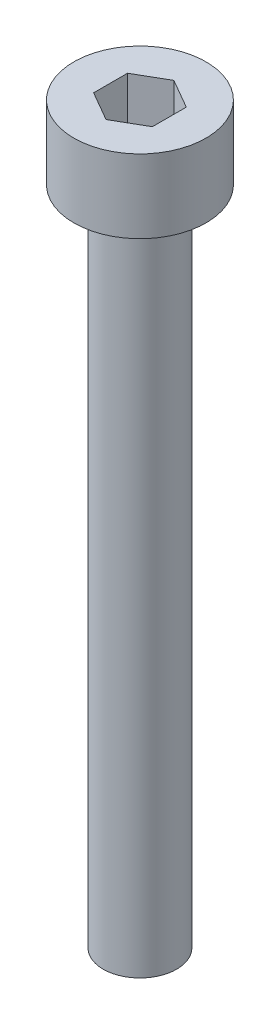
ISO-10303-21;
HEADER;
FILE_DESCRIPTION(('STEP AP214'),'2;1');
FILE_NAME('part.step','',(''),(''),'','','');
FILE_SCHEMA(('AUTOMOTIVE_DESIGN { 1 0 10303 214 1 1 1 1 }'));
ENDSEC;
DATA;
#1=APPLICATION_CONTEXT('core data for automotive mechanical design processes');
#2=APPLICATION_PROTOCOL_DEFINITION('international standard','automotive_design',2000,#1);
#3=PRODUCT_CONTEXT('',#1,'mechanical');
#4=PRODUCT('Part','Part','',(#3));
#5=PRODUCT_RELATED_PRODUCT_CATEGORY('part','',(#4));
#6=PRODUCT_DEFINITION_FORMATION('','',#4);
#7=PRODUCT_DEFINITION_CONTEXT('part definition',#1,'design');
#8=PRODUCT_DEFINITION('design','',#6,#7);
#9=PRODUCT_DEFINITION_SHAPE('','',#8);
#10=(LENGTH_UNIT() NAMED_UNIT(*) SI_UNIT(.MILLI.,.METRE.));
#11=(NAMED_UNIT(*) PLANE_ANGLE_UNIT() SI_UNIT($,.RADIAN.));
#12=(NAMED_UNIT(*) SI_UNIT($,.STERADIAN.) SOLID_ANGLE_UNIT());
#13=UNCERTAINTY_MEASURE_WITH_UNIT(LENGTH_MEASURE(1.E-05),#10,'distance_accuracy_value','');
#14=(GEOMETRIC_REPRESENTATION_CONTEXT(3) GLOBAL_UNCERTAINTY_ASSIGNED_CONTEXT((#13)) GLOBAL_UNIT_ASSIGNED_CONTEXT((#10,
#11,#12)) REPRESENTATION_CONTEXT('',''));
#15=CARTESIAN_POINT('',(0.,0.,0.));
#16=DIRECTION('',(0.,0.,1.));
#17=DIRECTION('',(1.,0.,0.));
#18=AXIS2_PLACEMENT_3D('',#15,#16,#17);
#19=CARTESIAN_POINT('',(0.,0.,0.));
#20=DIRECTION('',(0.,1.,0.));
#21=DIRECTION('',(0.,0.,1.));
#22=AXIS2_PLACEMENT_3D('',#19,#20,#21);
#23=PLANE('',#22);
#24=CARTESIAN_POINT('',(0.,0.,0.));
#25=DIRECTION('',(0.,1.,0.));
#26=DIRECTION('',(0.,0.,1.));
#27=AXIS2_PLACEMENT_3D('',#24,#25,#26);
#28=CIRCLE('',#27,4.5);
#29=CARTESIAN_POINT('',(0.,0.,4.5));
#30=VERTEX_POINT('',#29);
#31=EDGE_CURVE('E141',#30,#30,#28,.T.);
#32=ORIENTED_EDGE('',*,*,#31,.F.);
#33=EDGE_LOOP('',(#32));
#34=FACE_BOUND('',#33,.T.);
#35=CARTESIAN_POINT('',(0.,0.,0.));
#36=DIRECTION('',(0.,1.,0.));
#37=DIRECTION('',(0.,0.,1.));
#38=AXIS2_PLACEMENT_3D('',#35,#36,#37);
#39=CIRCLE('',#38,2.5);
#40=CARTESIAN_POINT('',(0.,0.,2.5));
#41=VERTEX_POINT('',#40);
#42=EDGE_CURVE('E11',#41,#41,#39,.F.);
#43=ORIENTED_EDGE('',*,*,#42,.F.);
#44=EDGE_LOOP('',(#43));
#45=FACE_BOUND('',#44,.T.);
#46=ADVANCED_FACE('F38',(#34,#45),#23,.F.);
#47=CARTESIAN_POINT('',(0.,5.,0.));
#48=DIRECTION('',(0.,-1.,0.));
#49=DIRECTION('',(0.,0.,-1.));
#50=AXIS2_PLACEMENT_3D('',#47,#48,#49);
#51=CYLINDRICAL_SURFACE('',#50,4.5);
#52=CARTESIAN_POINT('',(0.,5.,0.));
#53=DIRECTION('',(0.,1.,0.));
#54=DIRECTION('',(0.,0.,1.));
#55=AXIS2_PLACEMENT_3D('',#52,#53,#54);
#56=CIRCLE('',#55,4.5);
#57=CARTESIAN_POINT('',(0.,5.,4.5));
#58=VERTEX_POINT('',#57);
#59=EDGE_CURVE('E46',#58,#58,#56,.T.);
#60=ORIENTED_EDGE('',*,*,#59,.F.);
#61=EDGE_LOOP('',(#60));
#62=FACE_BOUND('',#61,.T.);
#63=ORIENTED_EDGE('',*,*,#31,.T.);
#64=EDGE_LOOP('',(#63));
#65=FACE_BOUND('',#64,.T.);
#66=ADVANCED_FACE('F40',(#62,#65),#51,.T.);
#67=CARTESIAN_POINT('',(0.,5.,0.));
#68=DIRECTION('',(0.,1.,0.));
#69=DIRECTION('',(0.,0.,1.));
#70=AXIS2_PLACEMENT_3D('',#67,#68,#69);
#71=PLANE('',#70);
#72=DIRECTION('',(0.866025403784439,0.,-0.5));
#73=VECTOR('',#72,1.);
#74=CARTESIAN_POINT('',(0.,5.,2.3094010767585));
#75=LINE('',#74,#73);
#76=CARTESIAN_POINT('',(0.,5.,2.3094010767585));
#77=VERTEX_POINT('',#76);
#78=CARTESIAN_POINT('',(2.,5.,1.15470053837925));
#79=VERTEX_POINT('',#78);
#80=EDGE_CURVE('E53',#77,#79,#75,.T.);
#81=ORIENTED_EDGE('',*,*,#80,.F.);
#82=DIRECTION('',(0.866025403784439,0.,0.5));
#83=VECTOR('',#82,1.);
#84=CARTESIAN_POINT('',(-2.,5.,1.15470053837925));
#85=LINE('',#84,#83);
#86=CARTESIAN_POINT('',(-2.,5.,1.15470053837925));
#87=VERTEX_POINT('',#86);
#88=EDGE_CURVE('E137',#87,#77,#85,.T.);
#89=ORIENTED_EDGE('',*,*,#88,.F.);
#90=DIRECTION('',(0.,0.,1.));
#91=VECTOR('',#90,1.);
#92=CARTESIAN_POINT('',(-2.,5.,-1.15470053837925));
#93=LINE('',#92,#91);
#94=CARTESIAN_POINT('',(-2.,5.,-1.15470053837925));
#95=VERTEX_POINT('',#94);
#96=EDGE_CURVE('E135',#95,#87,#93,.T.);
#97=ORIENTED_EDGE('',*,*,#96,.F.);
#98=DIRECTION('',(-0.866025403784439,0.,0.5));
#99=VECTOR('',#98,1.);
#100=CARTESIAN_POINT('',(0.,5.,-2.3094010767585));
#101=LINE('',#100,#99);
#102=CARTESIAN_POINT('',(0.,5.,-2.3094010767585));
#103=VERTEX_POINT('',#102);
#104=EDGE_CURVE('E101',#103,#95,#101,.T.);
#105=ORIENTED_EDGE('',*,*,#104,.F.);
#106=DIRECTION('',(-0.866025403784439,0.,-0.5));
#107=VECTOR('',#106,1.);
#108=CARTESIAN_POINT('',(2.,5.,-1.15470053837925));
#109=LINE('',#108,#107);
#110=CARTESIAN_POINT('',(2.,5.,-1.15470053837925));
#111=VERTEX_POINT('',#110);
#112=EDGE_CURVE('E131',#111,#103,#109,.T.);
#113=ORIENTED_EDGE('',*,*,#112,.F.);
#114=DIRECTION('',(0.,0.,-1.));
#115=VECTOR('',#114,1.);
#116=CARTESIAN_POINT('',(2.,5.,1.15470053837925));
#117=LINE('',#116,#115);
#118=EDGE_CURVE('E127',#79,#111,#117,.T.);
#119=ORIENTED_EDGE('',*,*,#118,.F.);
#120=EDGE_LOOP('',(#81,#89,#97,#105,#113,#119));
#121=FACE_BOUND('',#120,.T.);
#122=ORIENTED_EDGE('',*,*,#59,.T.);
#123=EDGE_LOOP('',(#122));
#124=FACE_BOUND('',#123,.T.);
#125=ADVANCED_FACE('F188',(#121,#124),#71,.T.);
#126=CARTESIAN_POINT('',(0.,2.,2.3094010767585));
#127=DIRECTION('',(0.5,0.,0.866025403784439));
#128=DIRECTION('',(0.866025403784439,0.,-0.5));
#129=AXIS2_PLACEMENT_3D('',#126,#127,#128);
#130=PLANE('',#129);
#131=ORIENTED_EDGE('',*,*,#80,.T.);
#132=DIRECTION('',(0.,1.,0.));
#133=VECTOR('',#132,1.);
#134=CARTESIAN_POINT('',(2.,2.,1.15470053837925));
#135=LINE('',#134,#133);
#136=CARTESIAN_POINT('',(2.,2.,1.15470053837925));
#137=VERTEX_POINT('',#136);
#138=EDGE_CURVE('E83',#137,#79,#135,.T.);
#139=ORIENTED_EDGE('',*,*,#138,.F.);
#140=DIRECTION('',(0.866025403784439,0.,-0.5));
#141=VECTOR('',#140,1.);
#142=CARTESIAN_POINT('',(0.,2.,2.3094010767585));
#143=LINE('',#142,#141);
#144=CARTESIAN_POINT('',(0.,2.,2.3094010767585));
#145=VERTEX_POINT('',#144);
#146=EDGE_CURVE('E139',#145,#137,#143,.T.);
#147=ORIENTED_EDGE('',*,*,#146,.F.);
#148=DIRECTION('',(0.,1.,0.));
#149=VECTOR('',#148,1.);
#150=CARTESIAN_POINT('',(0.,2.,2.3094010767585));
#151=LINE('',#150,#149);
#152=EDGE_CURVE('E61',#145,#77,#151,.T.);
#153=ORIENTED_EDGE('',*,*,#152,.T.);
#154=EDGE_LOOP('',(#131,#139,#147,#153));
#155=FACE_BOUND('',#154,.T.);
#156=ADVANCED_FACE('F174',(#155),#130,.F.);
#157=CARTESIAN_POINT('',(-2.,2.,1.15470053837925));
#158=DIRECTION('',(-0.5,0.,0.866025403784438));
#159=DIRECTION('',(0.866025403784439,0.,0.5));
#160=AXIS2_PLACEMENT_3D('',#157,#158,#159);
#161=PLANE('',#160);
#162=ORIENTED_EDGE('',*,*,#88,.T.);
#163=ORIENTED_EDGE('',*,*,#152,.F.);
#164=DIRECTION('',(0.866025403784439,0.,0.5));
#165=VECTOR('',#164,1.);
#166=CARTESIAN_POINT('',(-2.,2.,1.15470053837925));
#167=LINE('',#166,#165);
#168=CARTESIAN_POINT('',(-2.,2.,1.15470053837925));
#169=VERTEX_POINT('',#168);
#170=EDGE_CURVE('E113',#169,#145,#167,.T.);
#171=ORIENTED_EDGE('',*,*,#170,.F.);
#172=DIRECTION('',(0.,1.,0.));
#173=VECTOR('',#172,1.);
#174=CARTESIAN_POINT('',(-2.,2.,1.15470053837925));
#175=LINE('',#174,#173);
#176=EDGE_CURVE('E105',#169,#87,#175,.T.);
#177=ORIENTED_EDGE('',*,*,#176,.T.);
#178=EDGE_LOOP('',(#162,#163,#171,#177));
#179=FACE_BOUND('',#178,.T.);
#180=ADVANCED_FACE('F171',(#179),#161,.F.);
#181=CARTESIAN_POINT('',(-2.,2.,-1.15470053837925));
#182=DIRECTION('',(-1.,0.,0.));
#183=DIRECTION('',(0.,0.,1.));
#184=AXIS2_PLACEMENT_3D('',#181,#182,#183);
#185=PLANE('',#184);
#186=ORIENTED_EDGE('',*,*,#96,.T.);
#187=ORIENTED_EDGE('',*,*,#176,.F.);
#188=DIRECTION('',(0.,0.,1.));
#189=VECTOR('',#188,1.);
#190=CARTESIAN_POINT('',(-2.,2.,-1.15470053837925));
#191=LINE('',#190,#189);
#192=CARTESIAN_POINT('',(-2.,2.,-1.15470053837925));
#193=VERTEX_POINT('',#192);
#194=EDGE_CURVE('E109',#193,#169,#191,.T.);
#195=ORIENTED_EDGE('',*,*,#194,.F.);
#196=DIRECTION('',(0.,1.,0.));
#197=VECTOR('',#196,1.);
#198=CARTESIAN_POINT('',(-2.,2.,-1.15470053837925));
#199=LINE('',#198,#197);
#200=EDGE_CURVE('E94',#193,#95,#199,.T.);
#201=ORIENTED_EDGE('',*,*,#200,.T.);
#202=EDGE_LOOP('',(#186,#187,#195,#201));
#203=FACE_BOUND('',#202,.T.);
#204=ADVANCED_FACE('F110',(#203),#185,.F.);
#205=CARTESIAN_POINT('',(0.,2.,-2.3094010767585));
#206=DIRECTION('',(-0.5,0.,-0.866025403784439));
#207=DIRECTION('',(-0.866025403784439,0.,0.5));
#208=AXIS2_PLACEMENT_3D('',#205,#206,#207);
#209=PLANE('',#208);
#210=ORIENTED_EDGE('',*,*,#104,.T.);
#211=ORIENTED_EDGE('',*,*,#200,.F.);
#212=DIRECTION('',(-0.866025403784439,0.,0.5));
#213=VECTOR('',#212,1.);
#214=CARTESIAN_POINT('',(0.,2.,-2.3094010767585));
#215=LINE('',#214,#213);
#216=CARTESIAN_POINT('',(0.,2.,-2.3094010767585));
#217=VERTEX_POINT('',#216);
#218=EDGE_CURVE('E98',#217,#193,#215,.T.);
#219=ORIENTED_EDGE('',*,*,#218,.F.);
#220=DIRECTION('',(0.,1.,0.));
#221=VECTOR('',#220,1.);
#222=CARTESIAN_POINT('',(0.,2.,-2.3094010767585));
#223=LINE('',#222,#221);
#224=EDGE_CURVE('E106',#217,#103,#223,.T.);
#225=ORIENTED_EDGE('',*,*,#224,.T.);
#226=EDGE_LOOP('',(#210,#211,#219,#225));
#227=FACE_BOUND('',#226,.T.);
#228=ADVANCED_FACE('F96',(#227),#209,.F.);
#229=CARTESIAN_POINT('',(2.,2.,-1.15470053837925));
#230=DIRECTION('',(0.5,0.,-0.866025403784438));
#231=DIRECTION('',(-0.866025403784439,0.,-0.5));
#232=AXIS2_PLACEMENT_3D('',#229,#230,#231);
#233=PLANE('',#232);
#234=ORIENTED_EDGE('',*,*,#112,.T.);
#235=ORIENTED_EDGE('',*,*,#224,.F.);
#236=DIRECTION('',(-0.866025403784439,0.,-0.5));
#237=VECTOR('',#236,1.);
#238=CARTESIAN_POINT('',(2.,2.,-1.15470053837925));
#239=LINE('',#238,#237);
#240=CARTESIAN_POINT('',(2.,2.,-1.15470053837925));
#241=VERTEX_POINT('',#240);
#242=EDGE_CURVE('E119',#241,#217,#239,.T.);
#243=ORIENTED_EDGE('',*,*,#242,.F.);
#244=DIRECTION('',(0.,1.,0.));
#245=VECTOR('',#244,1.);
#246=CARTESIAN_POINT('',(2.,2.,-1.15470053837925));
#247=LINE('',#246,#245);
#248=EDGE_CURVE('E144',#241,#111,#247,.T.);
#249=ORIENTED_EDGE('',*,*,#248,.T.);
#250=EDGE_LOOP('',(#234,#235,#243,#249));
#251=FACE_BOUND('',#250,.T.);
#252=ADVANCED_FACE('F179',(#251),#233,.F.);
#253=CARTESIAN_POINT('',(2.,2.,1.15470053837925));
#254=DIRECTION('',(1.,0.,0.));
#255=DIRECTION('',(0.,0.,-1.));
#256=AXIS2_PLACEMENT_3D('',#253,#254,#255);
#257=PLANE('',#256);
#258=ORIENTED_EDGE('',*,*,#118,.T.);
#259=ORIENTED_EDGE('',*,*,#248,.F.);
#260=DIRECTION('',(0.,0.,-1.));
#261=VECTOR('',#260,1.);
#262=CARTESIAN_POINT('',(2.,2.,1.15470053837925));
#263=LINE('',#262,#261);
#264=EDGE_CURVE('E121',#137,#241,#263,.T.);
#265=ORIENTED_EDGE('',*,*,#264,.F.);
#266=ORIENTED_EDGE('',*,*,#138,.T.);
#267=EDGE_LOOP('',(#258,#259,#265,#266));
#268=FACE_BOUND('',#267,.T.);
#269=ADVANCED_FACE('F167',(#268),#257,.F.);
#270=CARTESIAN_POINT('',(0.,2.,0.));
#271=DIRECTION('',(0.,1.,0.));
#272=DIRECTION('',(0.,0.,1.));
#273=AXIS2_PLACEMENT_3D('',#270,#271,#272);
#274=PLANE('',#273);
#275=ORIENTED_EDGE('',*,*,#146,.T.);
#276=ORIENTED_EDGE('',*,*,#264,.T.);
#277=ORIENTED_EDGE('',*,*,#242,.T.);
#278=ORIENTED_EDGE('',*,*,#218,.T.);
#279=ORIENTED_EDGE('',*,*,#194,.T.);
#280=ORIENTED_EDGE('',*,*,#170,.T.);
#281=EDGE_LOOP('',(#275,#276,#277,#278,#279,#280));
#282=FACE_BOUND('',#281,.T.);
#283=ADVANCED_FACE('F116',(#282),#274,.T.);
#284=CARTESIAN_POINT('',(0.,-45.,0.));
#285=DIRECTION('',(0.,1.,0.));
#286=DIRECTION('',(0.,0.,1.));
#287=AXIS2_PLACEMENT_3D('',#284,#285,#286);
#288=CYLINDRICAL_SURFACE('',#287,2.5);
#289=CARTESIAN_POINT('',(0.,-45.,0.));
#290=DIRECTION('',(0.,-1.,0.));
#291=DIRECTION('',(0.,0.,-1.));
#292=AXIS2_PLACEMENT_3D('',#289,#290,#291);
#293=CIRCLE('',#292,2.5);
#294=CARTESIAN_POINT('',(0.,-45.,2.5));
#295=VERTEX_POINT('',#294);
#296=EDGE_CURVE('E128',#295,#295,#293,.T.);
#297=CARTESIAN_POINT('',(0.,-45.,2.5));
#298=CARTESIAN_POINT('',(0.,-44.53125,2.5));
#299=CARTESIAN_POINT('',(0.,-44.0625,2.5));
#300=CARTESIAN_POINT('',(0.,-43.125,2.5));
#301=CARTESIAN_POINT('',(0.,-42.65625,2.5));
#302=CARTESIAN_POINT('',(0.,-41.71875,2.5));
#303=CARTESIAN_POINT('',(0.,-41.25,2.5));
#304=CARTESIAN_POINT('',(0.,-40.3125,2.5));
#305=CARTESIAN_POINT('',(0.,-39.84375,2.5));
#306=CARTESIAN_POINT('',(0.,-38.90625,2.5));
#307=CARTESIAN_POINT('',(0.,-38.4375,2.5));
#308=CARTESIAN_POINT('',(0.,-37.5,2.5));
#309=CARTESIAN_POINT('',(0.,-37.03125,2.5));
#310=CARTESIAN_POINT('',(0.,-36.09375,2.5));
#311=CARTESIAN_POINT('',(0.,-35.625,2.5));
#312=CARTESIAN_POINT('',(0.,-34.6875,2.5));
#313=CARTESIAN_POINT('',(0.,-34.21875,2.5));
#314=CARTESIAN_POINT('',(0.,-33.28125,2.5));
#315=CARTESIAN_POINT('',(0.,-32.8125,2.5));
#316=CARTESIAN_POINT('',(0.,-31.875,2.5));
#317=CARTESIAN_POINT('',(0.,-31.40625,2.5));
#318=CARTESIAN_POINT('',(0.,-30.46875,2.5));
#319=CARTESIAN_POINT('',(0.,-30.,2.5));
#320=CARTESIAN_POINT('',(0.,-29.0625,2.5));
#321=CARTESIAN_POINT('',(0.,-28.59375,2.5));
#322=CARTESIAN_POINT('',(0.,-27.65625,2.5));
#323=CARTESIAN_POINT('',(0.,-27.1875,2.5));
#324=CARTESIAN_POINT('',(0.,-26.25,2.5));
#325=CARTESIAN_POINT('',(0.,-25.78125,2.5));
#326=CARTESIAN_POINT('',(0.,-24.84375,2.5));
#327=CARTESIAN_POINT('',(0.,-24.375,2.5));
#328=CARTESIAN_POINT('',(0.,-23.4375,2.5));
#329=CARTESIAN_POINT('',(0.,-22.96875,2.5));
#330=CARTESIAN_POINT('',(0.,-22.03125,2.5));
#331=CARTESIAN_POINT('',(0.,-21.5625,2.5));
#332=CARTESIAN_POINT('',(0.,-20.625,2.5));
#333=CARTESIAN_POINT('',(0.,-20.15625,2.5));
#334=CARTESIAN_POINT('',(0.,-19.21875,2.5));
#335=CARTESIAN_POINT('',(0.,-18.75,2.5));
#336=CARTESIAN_POINT('',(0.,-17.8125,2.5));
#337=CARTESIAN_POINT('',(0.,-17.34375,2.5));
#338=CARTESIAN_POINT('',(0.,-16.40625,2.5));
#339=CARTESIAN_POINT('',(0.,-15.9375,2.5));
#340=CARTESIAN_POINT('',(0.,-15.,2.5));
#341=CARTESIAN_POINT('',(0.,-14.53125,2.5));
#342=CARTESIAN_POINT('',(0.,-13.59375,2.5));
#343=CARTESIAN_POINT('',(0.,-13.125,2.5));
#344=CARTESIAN_POINT('',(0.,-12.1875,2.5));
#345=CARTESIAN_POINT('',(0.,-11.71875,2.5));
#346=CARTESIAN_POINT('',(0.,-10.78125,2.5));
#347=CARTESIAN_POINT('',(0.,-10.3125,2.5));
#348=CARTESIAN_POINT('',(0.,-9.37500000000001,2.5));
#349=CARTESIAN_POINT('',(0.,-8.90625000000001,2.5));
#350=CARTESIAN_POINT('',(0.,-7.96875000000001,2.5));
#351=CARTESIAN_POINT('',(0.,-7.5,2.5));
#352=CARTESIAN_POINT('',(0.,-6.5625,2.5));
#353=CARTESIAN_POINT('',(0.,-6.09375,2.5));
#354=CARTESIAN_POINT('',(0.,-5.15625000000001,2.5));
#355=CARTESIAN_POINT('',(0.,-4.68750000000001,2.5));
#356=CARTESIAN_POINT('',(0.,-3.75000000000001,2.5));
#357=CARTESIAN_POINT('',(0.,-3.28125000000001,2.5));
#358=CARTESIAN_POINT('',(0.,-2.34375000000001,2.5));
#359=CARTESIAN_POINT('',(0.,-1.87500000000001,2.5));
#360=CARTESIAN_POINT('',(0.,-0.937500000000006,2.5));
#361=CARTESIAN_POINT('',(0.,-0.468750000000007,2.5));
#362=CARTESIAN_POINT('',(0.,0.,2.5));
#363=B_SPLINE_CURVE_WITH_KNOTS('',3,(#297,#298,#299,#300,#301,#302,#303,#304,#305,#306,#307,
#308,#309,#310,#311,#312,#313,#314,#315,#316,#317,#318,#319,#320,#321,#322,#323,#324,#325,#326,
#327,#328,#329,#330,#331,#332,#333,#334,#335,#336,#337,#338,#339,#340,#341,#342,#343,#344,#345,
#346,#347,#348,#349,#350,#351,#352,#353,#354,#355,#356,#357,#358,#359,#360,#361,#362),
.UNSPECIFIED.,.F.,.F.,(4,2,2,2,2,2,2,2,2,2,2,2,2,2,2,2,2,2,2,2,2,2,2,2,2,2,2,2,2,2,2,2,4),(0.,
1.40625,2.8125,4.21874999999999,5.625,7.03125,8.43749999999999,9.84374999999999,11.25,12.65625,
14.0625,15.46875,16.875,18.28125,19.6875,21.09375,22.5,23.90625,25.3125,26.71875,28.125,
29.53125,30.9375,32.34375,33.75,35.15625,36.5625,37.96875,39.375,40.78125,42.1875,43.59375,45.),.UNSPECIFIED.);
#364=EDGE_CURVE('BSEAM156',#295,#41,#363,.T.);
#365=ORIENTED_EDGE('',*,*,#296,.F.);
#366=ORIENTED_EDGE('',*,*,#42,.T.);
#367=ORIENTED_EDGE('',*,*,#364,.T.);
#368=ORIENTED_EDGE('',*,*,#364,.F.);
#369=EDGE_LOOP('',(#365,#367,#366,#368));
#370=FACE_BOUND('',#369,.T.);
#371=ADVANCED_FACE('F156',(#370),#288,.T.);
#372=CARTESIAN_POINT('',(0.,-45.,0.));
#373=DIRECTION('',(0.,-1.,0.));
#374=DIRECTION('',(0.,0.,-1.));
#375=AXIS2_PLACEMENT_3D('',#372,#373,#374);
#376=PLANE('',#375);
#377=ORIENTED_EDGE('',*,*,#296,.T.);
#378=EDGE_LOOP('',(#377));
#379=FACE_BOUND('',#378,.T.);
#380=ADVANCED_FACE('F158',(#379),#376,.T.);
#381=CLOSED_SHELL('',(#46,#66,#125,#156,#180,#204,#228,#252,#269,#283,#371,#380));
#382=MANIFOLD_SOLID_BREP('B2',#381);
#383=ADVANCED_BREP_SHAPE_REPRESENTATION('',(#18,#382),#14);
#384=SHAPE_DEFINITION_REPRESENTATION(#9,#383);
ENDSEC;
END-ISO-10303-21;
